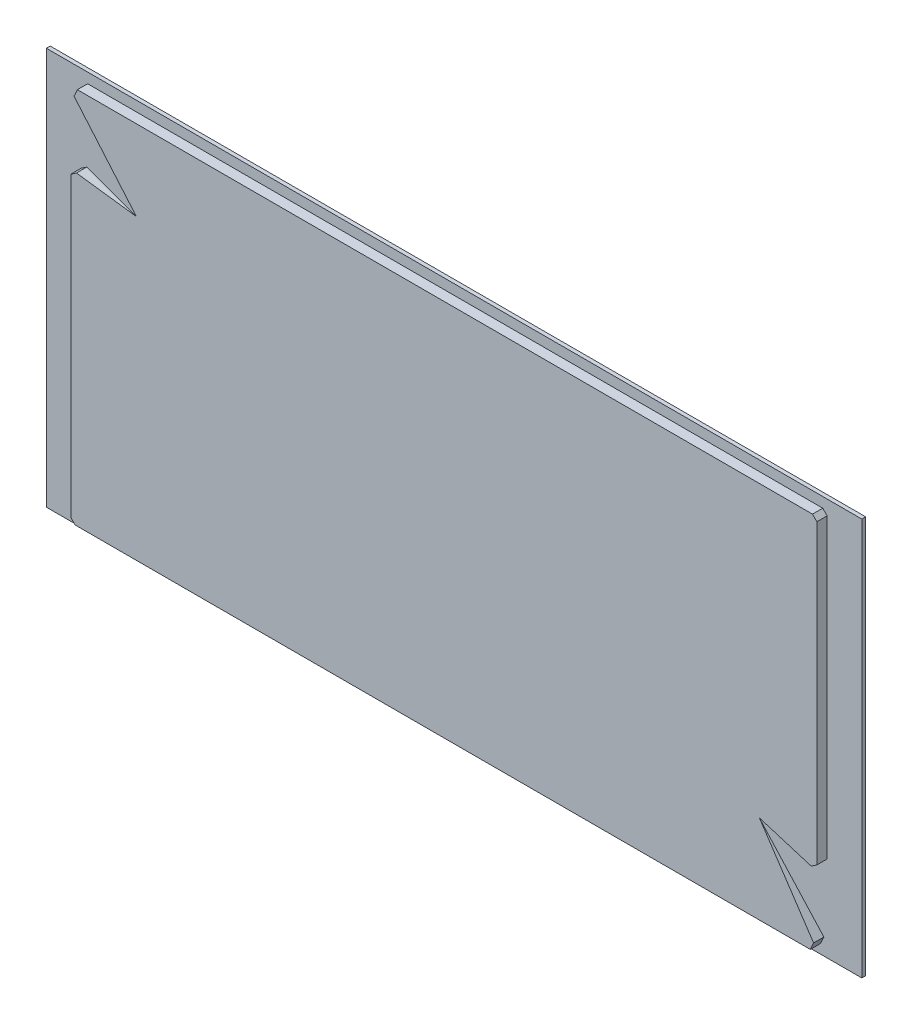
ISO-10303-21;
HEADER;
FILE_DESCRIPTION(('STEP AP214'),'2;1');
FILE_NAME('part.step','',(''),(''),'','','');
FILE_SCHEMA(('AUTOMOTIVE_DESIGN { 1 0 10303 214 1 1 1 1 }'));
ENDSEC;
DATA;
#1=APPLICATION_CONTEXT('core data for automotive mechanical design processes');
#2=APPLICATION_PROTOCOL_DEFINITION('international standard','automotive_design',2000,#1);
#3=PRODUCT_CONTEXT('',#1,'mechanical');
#4=PRODUCT('Part','Part','',(#3));
#5=PRODUCT_RELATED_PRODUCT_CATEGORY('part','',(#4));
#6=PRODUCT_DEFINITION_FORMATION('','',#4);
#7=PRODUCT_DEFINITION_CONTEXT('part definition',#1,'design');
#8=PRODUCT_DEFINITION('design','',#6,#7);
#9=PRODUCT_DEFINITION_SHAPE('','',#8);
#10=(LENGTH_UNIT() NAMED_UNIT(*) SI_UNIT(.MILLI.,.METRE.));
#11=(NAMED_UNIT(*) PLANE_ANGLE_UNIT() SI_UNIT($,.RADIAN.));
#12=(NAMED_UNIT(*) SI_UNIT($,.STERADIAN.) SOLID_ANGLE_UNIT());
#13=UNCERTAINTY_MEASURE_WITH_UNIT(LENGTH_MEASURE(1.E-05),#10,'distance_accuracy_value','');
#14=(GEOMETRIC_REPRESENTATION_CONTEXT(3) GLOBAL_UNCERTAINTY_ASSIGNED_CONTEXT((#13)) GLOBAL_UNIT_ASSIGNED_CONTEXT((#10,
#11,#12)) REPRESENTATION_CONTEXT('',''));
#15=CARTESIAN_POINT('',(0.,0.,0.));
#16=DIRECTION('',(0.,0.,1.));
#17=DIRECTION('',(1.,0.,0.));
#18=AXIS2_PLACEMENT_3D('',#15,#16,#17);
#19=CARTESIAN_POINT('',(-20.473861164,-11.721561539,-10.367481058));
#20=DIRECTION('',(0.,0.,1.));
#21=DIRECTION('',(1.,0.,0.));
#22=AXIS2_PLACEMENT_3D('',#19,#20,#21);
#23=PLANE('',#22);
#24=DIRECTION('',(1.,0.,0.));
#25=VECTOR('',#24,1.);
#26=CARTESIAN_POINT('',(-4.573861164,3.778438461,-10.367481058));
#27=LINE('',#26,#25);
#28=CARTESIAN_POINT('',(-20.473861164,3.778438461,-10.367481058));
#29=VERTEX_POINT('',#28);
#30=CARTESIAN_POINT('',(11.326138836,3.778438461,-10.367481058));
#31=VERTEX_POINT('',#30);
#32=EDGE_CURVE('P0_E80',#29,#31,#27,.T.);
#33=ORIENTED_EDGE('',*,*,#32,.T.);
#34=DIRECTION('',(0.,-1.,0.));
#35=VECTOR('',#34,1.);
#36=CARTESIAN_POINT('',(11.326138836,-3.971561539,-10.367481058));
#37=LINE('',#36,#35);
#38=CARTESIAN_POINT('',(11.326138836,-11.721561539,-10.367481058));
#39=VERTEX_POINT('',#38);
#40=EDGE_CURVE('P0_E67',#31,#39,#37,.T.);
#41=ORIENTED_EDGE('',*,*,#40,.T.);
#42=DIRECTION('',(-1.,0.,0.));
#43=VECTOR('',#42,1.);
#44=CARTESIAN_POINT('',(-4.573861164,-11.721561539,-10.367481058));
#45=LINE('',#44,#43);
#46=CARTESIAN_POINT('',(-20.473861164,-11.721561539,-10.367481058));
#47=VERTEX_POINT('',#46);
#48=EDGE_CURVE('P0_E54',#39,#47,#45,.T.);
#49=ORIENTED_EDGE('',*,*,#48,.T.);
#50=DIRECTION('',(0.,1.,0.));
#51=VECTOR('',#50,1.);
#52=CARTESIAN_POINT('',(-20.473861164,-3.971561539,-10.367481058));
#53=LINE('',#52,#51);
#54=EDGE_CURVE('P0_E19',#47,#29,#53,.T.);
#55=ORIENTED_EDGE('',*,*,#54,.T.);
#56=EDGE_LOOP('',(#33,#41,#49,#55));
#57=FACE_BOUND('',#56,.T.);
#58=ADVANCED_FACE('P0_F15',(#57),#23,.F.);
#59=CARTESIAN_POINT('',(-20.473861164,-11.721561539,-10.367481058));
#60=DIRECTION('',(1.,0.,0.));
#61=DIRECTION('',(0.,1.,0.));
#62=AXIS2_PLACEMENT_3D('',#59,#60,#61);
#63=PLANE('',#62);
#64=DIRECTION('',(0.,0.,1.));
#65=VECTOR('',#64,1.);
#66=CARTESIAN_POINT('',(-20.473861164,-11.721561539,-10.292481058));
#67=LINE('',#66,#65);
#68=CARTESIAN_POINT('',(-20.473861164,-11.721561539,-10.217481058));
#69=VERTEX_POINT('',#68);
#70=EDGE_CURVE('P0_E60',#47,#69,#67,.T.);
#71=ORIENTED_EDGE('',*,*,#70,.T.);
#72=DIRECTION('',(0.,-1.,0.));
#73=VECTOR('',#72,1.);
#74=CARTESIAN_POINT('',(-20.473861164,-3.971561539,-10.217481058));
#75=LINE('',#74,#73);
#76=CARTESIAN_POINT('',(-20.473861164,3.778438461,-10.217481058));
#77=VERTEX_POINT('',#76);
#78=EDGE_CURVE('P0_E82',#77,#69,#75,.T.);
#79=ORIENTED_EDGE('',*,*,#78,.F.);
#80=DIRECTION('',(0.,0.,-1.));
#81=VECTOR('',#80,1.);
#82=CARTESIAN_POINT('',(-20.473861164,3.778438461,-10.292481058));
#83=LINE('',#82,#81);
#84=EDGE_CURVE('P0_E63',#77,#29,#83,.T.);
#85=ORIENTED_EDGE('',*,*,#84,.T.);
#86=ORIENTED_EDGE('',*,*,#54,.F.);
#87=EDGE_LOOP('',(#71,#79,#85,#86));
#88=FACE_BOUND('',#87,.T.);
#89=ADVANCED_FACE('P0_F59',(#88),#63,.F.);
#90=CARTESIAN_POINT('',(-20.473861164,-11.721561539,-10.367481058));
#91=DIRECTION('',(0.,1.,0.));
#92=DIRECTION('',(0.,0.,1.));
#93=AXIS2_PLACEMENT_3D('',#90,#91,#92);
#94=PLANE('',#93);
#95=DIRECTION('',(0.,0.,1.));
#96=VECTOR('',#95,1.);
#97=CARTESIAN_POINT('',(11.326138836,-11.721561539,-10.292481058));
#98=LINE('',#97,#96);
#99=CARTESIAN_POINT('',(11.326138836,-11.721561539,-10.217481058));
#100=VERTEX_POINT('',#99);
#101=EDGE_CURVE('P0_E69',#39,#100,#98,.T.);
#102=ORIENTED_EDGE('',*,*,#101,.T.);
#103=DIRECTION('',(1.,0.,0.));
#104=VECTOR('',#103,1.);
#105=CARTESIAN_POINT('',(-4.573861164,-11.721561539,-10.217481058));
#106=LINE('',#105,#104);
#107=EDGE_CURVE('P0_E73',#69,#100,#106,.T.);
#108=ORIENTED_EDGE('',*,*,#107,.F.);
#109=ORIENTED_EDGE('',*,*,#70,.F.);
#110=ORIENTED_EDGE('',*,*,#48,.F.);
#111=EDGE_LOOP('',(#102,#108,#109,#110));
#112=FACE_BOUND('',#111,.T.);
#113=ADVANCED_FACE('P0_F71',(#112),#94,.F.);
#114=CARTESIAN_POINT('',(11.326138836,3.778438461,-10.367481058));
#115=DIRECTION('',(-1.,0.,0.));
#116=DIRECTION('',(0.,-1.,0.));
#117=AXIS2_PLACEMENT_3D('',#114,#115,#116);
#118=PLANE('',#117);
#119=DIRECTION('',(0.,0.,1.));
#120=VECTOR('',#119,1.);
#121=CARTESIAN_POINT('',(11.326138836,3.778438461,-10.292481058));
#122=LINE('',#121,#120);
#123=CARTESIAN_POINT('',(11.326138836,3.778438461,-10.217481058));
#124=VERTEX_POINT('',#123);
#125=EDGE_CURVE('P0_E34',#31,#124,#122,.T.);
#126=ORIENTED_EDGE('',*,*,#125,.T.);
#127=DIRECTION('',(0.,1.,0.));
#128=VECTOR('',#127,1.);
#129=CARTESIAN_POINT('',(11.326138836,-3.971561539,-10.217481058));
#130=LINE('',#129,#128);
#131=EDGE_CURVE('P0_E25',#100,#124,#130,.T.);
#132=ORIENTED_EDGE('',*,*,#131,.F.);
#133=ORIENTED_EDGE('',*,*,#101,.F.);
#134=ORIENTED_EDGE('',*,*,#40,.F.);
#135=EDGE_LOOP('',(#126,#132,#133,#134));
#136=FACE_BOUND('',#135,.T.);
#137=ADVANCED_FACE('P0_F87',(#136),#118,.F.);
#138=CARTESIAN_POINT('',(-20.473861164,3.778438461,-10.217481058));
#139=DIRECTION('',(0.,-1.,0.));
#140=DIRECTION('',(0.,0.,-1.));
#141=AXIS2_PLACEMENT_3D('',#138,#139,#140);
#142=PLANE('',#141);
#143=ORIENTED_EDGE('',*,*,#84,.F.);
#144=DIRECTION('',(-1.,0.,0.));
#145=VECTOR('',#144,1.);
#146=CARTESIAN_POINT('',(-4.573861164,3.778438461,-10.217481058));
#147=LINE('',#146,#145);
#148=EDGE_CURVE('P0_E10',#124,#77,#147,.T.);
#149=ORIENTED_EDGE('',*,*,#148,.F.);
#150=ORIENTED_EDGE('',*,*,#125,.F.);
#151=ORIENTED_EDGE('',*,*,#32,.F.);
#152=EDGE_LOOP('',(#143,#149,#150,#151));
#153=FACE_BOUND('',#152,.T.);
#154=ADVANCED_FACE('P0_F89',(#153),#142,.F.);
#155=CARTESIAN_POINT('',(-20.473861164,-11.721561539,-10.217481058));
#156=DIRECTION('',(0.,0.,1.));
#157=DIRECTION('',(1.,0.,0.));
#158=AXIS2_PLACEMENT_3D('',#155,#156,#157);
#159=PLANE('',#158);
#160=ORIENTED_EDGE('',*,*,#131,.T.);
#161=ORIENTED_EDGE('',*,*,#148,.T.);
#162=ORIENTED_EDGE('',*,*,#78,.T.);
#163=ORIENTED_EDGE('',*,*,#107,.T.);
#164=EDGE_LOOP('',(#160,#161,#162,#163));
#165=FACE_BOUND('',#164,.T.);
#166=ADVANCED_FACE('P0_F17',(#165),#159,.T.);
#167=CLOSED_SHELL('',(#58,#89,#113,#137,#154,#166));
#168=MANIFOLD_SOLID_BREP('P0_B1',#167);
#169=CARTESIAN_POINT('',(9.846403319,-11.361617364,-9.817481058));
#170=DIRECTION('',(0.,0.,-1.));
#171=DIRECTION('',(-1.,0.,0.));
#172=AXIS2_PLACEMENT_3D('',#169,#170,#171);
#173=PLANE('',#172);
#174=DIRECTION('',(-0.707106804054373,0.707106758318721,0.));
#175=VECTOR('',#174,1.);
#176=CARTESIAN_POINT('',(-18.9503386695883,-11.361617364,-9.817481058));
#177=LINE('',#176,#175);
#178=CARTESIAN_POINT('',(-18.9503386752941,-11.361617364,-9.817481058));
#179=VERTEX_POINT('',#178);
#180=CARTESIAN_POINT('',(-19.121788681,-11.1901673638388,-9.817481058));
#181=VERTEX_POINT('',#180);
#182=EDGE_CURVE('P1_E24',#179,#181,#177,.T.);
#183=ORIENTED_EDGE('',*,*,#182,.T.);
#184=DIRECTION('',(0.,1.,0.));
#185=VECTOR('',#184,1.);
#186=CARTESIAN_POINT('',(-19.121788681,-5.405444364,-9.817481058));
#187=LINE('',#186,#185);
#188=CARTESIAN_POINT('',(-19.121788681,0.399852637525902,-9.817481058));
#189=VERTEX_POINT('',#188);
#190=EDGE_CURVE('P1_E11',#181,#189,#187,.T.);
#191=ORIENTED_EDGE('',*,*,#190,.T.);
#192=DIRECTION('',(0.826767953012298,0.56254311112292,0.));
#193=VECTOR('',#192,1.);
#194=CARTESIAN_POINT('',(-19.121788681,0.399852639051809,-9.817481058));
#195=LINE('',#194,#193);
#196=CARTESIAN_POINT('',(-18.9000466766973,0.550728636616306,-9.817481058));
#197=VERTEX_POINT('',#196);
#198=EDGE_CURVE('P1_E198',#189,#197,#195,.T.);
#199=ORIENTED_EDGE('',*,*,#198,.T.);
#200=DIRECTION('',(0.94832915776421,-0.317288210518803,0.));
#201=VECTOR('',#200,1.);
#202=CARTESIAN_POINT('',(-18.900046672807,0.550728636,-9.817481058));
#203=LINE('',#202,#201);
#204=CARTESIAN_POINT('',(-16.7213717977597,0.0910334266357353,-9.97611658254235));
#205=VERTEX_POINT('',#204);
#206=EDGE_CURVE('P1_E193',#197,#205,#203,.T.);
#207=ORIENTED_EDGE('',*,*,#206,.T.);
#208=DIRECTION('',(-0.644253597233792,0.764811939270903,0.));
#209=VECTOR('',#208,1.);
#210=CARTESIAN_POINT('',(-16.6852656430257,0.358453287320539,-9.817481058));
#211=LINE('',#210,#209);
#212=CARTESIAN_POINT('',(-18.9941256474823,3.09936728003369,-9.817481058));
#213=VERTEX_POINT('',#212);
#214=EDGE_CURVE('P1_E33',#205,#213,#211,.T.);
#215=ORIENTED_EDGE('',*,*,#214,.T.);
#216=DIRECTION('',(0.417663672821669,0.908601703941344,0.));
#217=VECTOR('',#216,1.);
#218=CARTESIAN_POINT('',(-18.994125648,3.09936727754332,-9.817481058));
#219=LINE('',#218,#217);
#220=CARTESIAN_POINT('',(-18.8638236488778,3.382831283,-9.817481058));
#221=VERTEX_POINT('',#220);
#222=EDGE_CURVE('P1_E172',#213,#221,#219,.T.);
#223=ORIENTED_EDGE('',*,*,#222,.T.);
#224=DIRECTION('',(1.,0.,0.));
#225=VECTOR('',#224,1.);
#226=CARTESIAN_POINT('',(-4.510029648,3.382831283,-9.817481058));
#227=LINE('',#226,#225);
#228=CARTESIAN_POINT('',(9.80261634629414,3.382831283,-9.817481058));
#229=VERTEX_POINT('',#228);
#230=EDGE_CURVE('P1_E168',#221,#229,#227,.T.);
#231=ORIENTED_EDGE('',*,*,#230,.T.);
#232=DIRECTION('',(0.70710680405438,-0.707106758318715,0.));
#233=VECTOR('',#232,1.);
#234=CARTESIAN_POINT('',(9.80261634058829,3.382831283,-9.817481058));
#235=LINE('',#234,#233);
#236=CARTESIAN_POINT('',(9.974066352,3.21138128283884,-9.817481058));
#237=VERTEX_POINT('',#236);
#238=EDGE_CURVE('P1_E171',#229,#237,#235,.T.);
#239=ORIENTED_EDGE('',*,*,#238,.T.);
#240=DIRECTION('',(0.,-1.,0.));
#241=VECTOR('',#240,1.);
#242=CARTESIAN_POINT('',(9.974066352,-2.573341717,-9.817481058));
#243=LINE('',#242,#241);
#244=CARTESIAN_POINT('',(9.974066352,-8.3786387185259,-9.817481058));
#245=VERTEX_POINT('',#244);
#246=EDGE_CURVE('P1_E176',#237,#245,#243,.T.);
#247=ORIENTED_EDGE('',*,*,#246,.T.);
#248=DIRECTION('',(-0.826767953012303,-0.562543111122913,0.));
#249=VECTOR('',#248,1.);
#250=CARTESIAN_POINT('',(9.974066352,-8.37863872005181,-9.817481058));
#251=LINE('',#250,#249);
#252=CARTESIAN_POINT('',(9.75232434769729,-8.52951471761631,-9.817481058));
#253=VERTEX_POINT('',#252);
#254=EDGE_CURVE('P1_E19',#245,#253,#251,.T.);
#255=ORIENTED_EDGE('',*,*,#254,.T.);
#256=DIRECTION('',(-0.94832915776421,0.317288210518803,0.));
#257=VECTOR('',#256,1.);
#258=CARTESIAN_POINT('',(9.75232434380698,-8.529514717,-9.817481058));
#259=LINE('',#258,#257);
#260=CARTESIAN_POINT('',(7.57364946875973,-8.06981950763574,-9.97611658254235));
#261=VERTEX_POINT('',#260);
#262=EDGE_CURVE('P1_E112',#253,#261,#259,.T.);
#263=ORIENTED_EDGE('',*,*,#262,.T.);
#264=DIRECTION('',(0.644253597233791,-0.764811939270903,0.));
#265=VECTOR('',#264,1.);
#266=CARTESIAN_POINT('',(7.53754331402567,-8.33723936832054,-9.817481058));
#267=LINE('',#266,#265);
#268=CARTESIAN_POINT('',(9.84640331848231,-11.0781533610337,-9.817481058));
#269=VERTEX_POINT('',#268);
#270=EDGE_CURVE('P1_E190',#261,#269,#267,.T.);
#271=ORIENTED_EDGE('',*,*,#270,.T.);
#272=DIRECTION('',(-0.417663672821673,-0.908601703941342,0.));
#273=VECTOR('',#272,1.);
#274=CARTESIAN_POINT('',(9.846403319,-11.0781533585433,-9.817481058));
#275=LINE('',#274,#273);
#276=CARTESIAN_POINT('',(9.71610131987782,-11.361617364,-9.817481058));
#277=VERTEX_POINT('',#276);
#278=EDGE_CURVE('P1_E147',#269,#277,#275,.T.);
#279=ORIENTED_EDGE('',*,*,#278,.T.);
#280=DIRECTION('',(-1.,0.,0.));
#281=VECTOR('',#280,1.);
#282=CARTESIAN_POINT('',(-4.637692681,-11.361617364,-9.817481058));
#283=LINE('',#282,#281);
#284=EDGE_CURVE('P1_E144',#277,#179,#283,.T.);
#285=ORIENTED_EDGE('',*,*,#284,.T.);
#286=EDGE_LOOP('',(#183,#191,#199,#207,#215,#223,#231,#239,#247,#255,#263,#271,#279,#285));
#287=FACE_BOUND('',#286,.T.);
#288=ADVANCED_FACE('P1_F16',(#287),#173,.T.);
#289=CARTESIAN_POINT('',(-19.121788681,-11.190167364,-9.817481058));
#290=DIRECTION('',(1.,0.,0.));
#291=DIRECTION('',(0.,0.,-1.));
#292=AXIS2_PLACEMENT_3D('',#289,#290,#291);
#293=PLANE('',#292);
#294=DIRECTION('',(0.,0.,-1.));
#295=VECTOR('',#294,1.);
#296=CARTESIAN_POINT('',(-19.121788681,-11.190167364,-10.017481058));
#297=LINE('',#296,#295);
#298=CARTESIAN_POINT('',(-19.121788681,-11.190167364,-10.217481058));
#299=VERTEX_POINT('',#298);
#300=EDGE_CURVE('P1_E148',#181,#299,#297,.T.);
#301=ORIENTED_EDGE('',*,*,#300,.T.);
#302=DIRECTION('',(0.,1.,0.));
#303=VECTOR('',#302,1.);
#304=CARTESIAN_POINT('',(-19.121788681,-5.395157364,-10.217481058));
#305=LINE('',#304,#303);
#306=CARTESIAN_POINT('',(-19.121788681,0.399852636,-10.217481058));
#307=VERTEX_POINT('',#306);
#308=EDGE_CURVE('P1_E150',#299,#307,#305,.T.);
#309=ORIENTED_EDGE('',*,*,#308,.T.);
#310=DIRECTION('',(0.,0.,1.));
#311=VECTOR('',#310,1.);
#312=CARTESIAN_POINT('',(-19.121788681,0.399852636,-10.017481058));
#313=LINE('',#312,#311);
#314=EDGE_CURVE('P1_E151',#307,#189,#313,.T.);
#315=ORIENTED_EDGE('',*,*,#314,.T.);
#316=ORIENTED_EDGE('',*,*,#190,.F.);
#317=EDGE_LOOP('',(#301,#309,#315,#316));
#318=FACE_BOUND('',#317,.T.);
#319=ADVANCED_FACE('P1_F244',(#318),#293,.T.);
#320=CARTESIAN_POINT('',(-18.950338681,-11.361617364,-10.217481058));
#321=DIRECTION('',(0.707106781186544,0.707106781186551,0.));
#322=DIRECTION('',(-0.707106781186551,0.707106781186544,0.));
#323=AXIS2_PLACEMENT_3D('',#320,#321,#322);
#324=PLANE('',#323);
#325=DIRECTION('',(0.,0.,-1.));
#326=VECTOR('',#325,1.);
#327=CARTESIAN_POINT('',(-18.950338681,-11.361617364,-10.017481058));
#328=LINE('',#327,#326);
#329=CARTESIAN_POINT('',(-18.950338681,-11.361617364,-10.217481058));
#330=VERTEX_POINT('',#329);
#331=EDGE_CURVE('P1_E139',#179,#330,#328,.T.);
#332=ORIENTED_EDGE('',*,*,#331,.T.);
#333=DIRECTION('',(-0.707106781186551,0.707106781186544,0.));
#334=VECTOR('',#333,1.);
#335=CARTESIAN_POINT('',(-19.036063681,-11.275892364,-10.217481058));
#336=LINE('',#335,#334);
#337=EDGE_CURVE('P1_E142',#330,#299,#336,.T.);
#338=ORIENTED_EDGE('',*,*,#337,.T.);
#339=ORIENTED_EDGE('',*,*,#300,.F.);
#340=ORIENTED_EDGE('',*,*,#182,.F.);
#341=EDGE_LOOP('',(#332,#338,#339,#340));
#342=FACE_BOUND('',#341,.T.);
#343=ADVANCED_FACE('P1_F286',(#342),#324,.T.);
#344=CARTESIAN_POINT('',(-18.950338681,-11.361617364,-10.217481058));
#345=DIRECTION('',(0.,1.,0.));
#346=DIRECTION('',(0.,0.,1.));
#347=AXIS2_PLACEMENT_3D('',#344,#345,#346);
#348=PLANE('',#347);
#349=DIRECTION('',(0.,0.,-1.));
#350=VECTOR('',#349,1.);
#351=CARTESIAN_POINT('',(9.716101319,-11.361617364,-10.017481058));
#352=LINE('',#351,#350);
#353=CARTESIAN_POINT('',(9.716101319,-11.361617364,-10.217481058));
#354=VERTEX_POINT('',#353);
#355=EDGE_CURVE('P1_E162',#277,#354,#352,.T.);
#356=ORIENTED_EDGE('',*,*,#355,.T.);
#357=DIRECTION('',(-1.,0.,0.));
#358=VECTOR('',#357,1.);
#359=CARTESIAN_POINT('',(-4.617118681,-11.361617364,-10.217481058));
#360=LINE('',#359,#358);
#361=EDGE_CURVE('P1_E143',#354,#330,#360,.T.);
#362=ORIENTED_EDGE('',*,*,#361,.T.);
#363=ORIENTED_EDGE('',*,*,#331,.F.);
#364=ORIENTED_EDGE('',*,*,#284,.F.);
#365=EDGE_LOOP('',(#356,#362,#363,#364));
#366=FACE_BOUND('',#365,.T.);
#367=ADVANCED_FACE('P1_F272',(#366),#348,.T.);
#368=CARTESIAN_POINT('',(9.846403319,-11.078153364,-10.217481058));
#369=DIRECTION('',(-0.908601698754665,0.417663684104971,0.));
#370=DIRECTION('',(-0.417663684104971,-0.908601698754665,0.));
#371=AXIS2_PLACEMENT_3D('',#368,#369,#370);
#372=PLANE('',#371);
#373=DIRECTION('',(0.,0.,-1.));
#374=VECTOR('',#373,1.);
#375=CARTESIAN_POINT('',(9.846403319,-11.078153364,-10.017481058));
#376=LINE('',#375,#374);
#377=CARTESIAN_POINT('',(9.846403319,-11.078153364,-10.217481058));
#378=VERTEX_POINT('',#377);
#379=EDGE_CURVE('P1_E133',#269,#378,#376,.T.);
#380=ORIENTED_EDGE('',*,*,#379,.T.);
#381=DIRECTION('',(-0.417663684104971,-0.908601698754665,0.));
#382=VECTOR('',#381,1.);
#383=CARTESIAN_POINT('',(9.781252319,-11.219885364,-10.217481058));
#384=LINE('',#383,#382);
#385=EDGE_CURVE('P1_E161',#378,#354,#384,.T.);
#386=ORIENTED_EDGE('',*,*,#385,.T.);
#387=ORIENTED_EDGE('',*,*,#355,.F.);
#388=ORIENTED_EDGE('',*,*,#278,.F.);
#389=EDGE_LOOP('',(#380,#386,#387,#388));
#390=FACE_BOUND('',#389,.T.);
#391=ADVANCED_FACE('P1_F265',(#390),#372,.T.);
#392=CARTESIAN_POINT('',(7.537543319,-8.337239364,-10.217481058));
#393=DIRECTION('',(-0.764811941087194,-0.64425359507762,0.));
#394=DIRECTION('',(0.64425359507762,-0.764811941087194,0.));
#395=AXIS2_PLACEMENT_3D('',#392,#393,#394);
#396=PLANE('',#395);
#397=ORIENTED_EDGE('',*,*,#270,.F.);
#398=DIRECTION('',(0.64425359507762,-0.764811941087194,0.));
#399=VECTOR('',#398,1.);
#400=CARTESIAN_POINT('',(8.691973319,-9.707696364,-10.217481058));
#401=LINE('',#400,#399);
#402=EDGE_CURVE('P1_E130',#261,#378,#401,.T.);
#403=ORIENTED_EDGE('',*,*,#402,.T.);
#404=ORIENTED_EDGE('',*,*,#379,.F.);
#405=EDGE_LOOP('',(#397,#403,#404));
#406=FACE_BOUND('',#405,.T.);
#407=ADVANCED_FACE('P1_F277',(#406),#396,.T.);
#408=CARTESIAN_POINT('',(-18.900046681,0.550728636,-10.217481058));
#409=DIRECTION('',(-0.317288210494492,-0.948329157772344,0.));
#410=DIRECTION('',(0.948329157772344,-0.317288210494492,0.));
#411=AXIS2_PLACEMENT_3D('',#408,#409,#410);
#412=PLANE('',#411);
#413=DIRECTION('',(0.,0.,-1.));
#414=VECTOR('',#413,1.);
#415=CARTESIAN_POINT('',(-18.900046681,0.550728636,-10.017481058));
#416=LINE('',#415,#414);
#417=CARTESIAN_POINT('',(-18.900046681,0.550728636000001,-10.217481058));
#418=VERTEX_POINT('',#417);
#419=EDGE_CURVE('P1_E155',#197,#418,#416,.T.);
#420=ORIENTED_EDGE('',*,*,#419,.T.);
#421=DIRECTION('',(0.948329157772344,-0.317288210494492,0.));
#422=VECTOR('',#421,1.);
#423=CARTESIAN_POINT('',(-5.716684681,-3.860108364,-10.217481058));
#424=LINE('',#423,#422);
#425=EDGE_CURVE('P1_E134',#418,#205,#424,.T.);
#426=ORIENTED_EDGE('',*,*,#425,.T.);
#427=ORIENTED_EDGE('',*,*,#206,.F.);
#428=EDGE_LOOP('',(#420,#426,#427));
#429=FACE_BOUND('',#428,.T.);
#430=ADVANCED_FACE('P1_F233',(#429),#412,.T.);
#431=CARTESIAN_POINT('',(-19.121788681,0.399852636,-10.217481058));
#432=DIRECTION('',(0.562543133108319,-0.826767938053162,0.));
#433=DIRECTION('',(0.826767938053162,0.562543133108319,0.));
#434=AXIS2_PLACEMENT_3D('',#431,#432,#433);
#435=PLANE('',#434);
#436=ORIENTED_EDGE('',*,*,#314,.F.);
#437=DIRECTION('',(0.826767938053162,0.562543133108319,0.));
#438=VECTOR('',#437,1.);
#439=CARTESIAN_POINT('',(-19.010917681,0.475290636,-10.217481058));
#440=LINE('',#439,#438);
#441=EDGE_CURVE('P1_E158',#307,#418,#440,.T.);
#442=ORIENTED_EDGE('',*,*,#441,.T.);
#443=ORIENTED_EDGE('',*,*,#419,.F.);
#444=ORIENTED_EDGE('',*,*,#198,.F.);
#445=EDGE_LOOP('',(#436,#442,#443,#444));
#446=FACE_BOUND('',#445,.T.);
#447=ADVANCED_FACE('P1_F238',(#446),#435,.T.);
#448=CARTESIAN_POINT('',(9.974066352,3.211381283,-9.817481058));
#449=DIRECTION('',(-1.,0.,0.));
#450=DIRECTION('',(0.,0.,-1.));
#451=AXIS2_PLACEMENT_3D('',#448,#449,#450);
#452=PLANE('',#451);
#453=DIRECTION('',(0.,0.,-1.));
#454=VECTOR('',#453,1.);
#455=CARTESIAN_POINT('',(9.974066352,3.211381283,-10.017481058));
#456=LINE('',#455,#454);
#457=CARTESIAN_POINT('',(9.974066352,3.211381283,-10.217481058));
#458=VERTEX_POINT('',#457);
#459=EDGE_CURVE('P1_E173',#237,#458,#456,.T.);
#460=ORIENTED_EDGE('',*,*,#459,.T.);
#461=DIRECTION('',(0.,-1.,0.));
#462=VECTOR('',#461,1.);
#463=CARTESIAN_POINT('',(9.974066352,-2.583628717,-10.217481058));
#464=LINE('',#463,#462);
#465=CARTESIAN_POINT('',(9.974066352,-8.378638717,-10.217481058));
#466=VERTEX_POINT('',#465);
#467=EDGE_CURVE('P1_E175',#458,#466,#464,.T.);
#468=ORIENTED_EDGE('',*,*,#467,.T.);
#469=DIRECTION('',(0.,0.,1.));
#470=VECTOR('',#469,1.);
#471=CARTESIAN_POINT('',(9.974066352,-8.378638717,-10.017481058));
#472=LINE('',#471,#470);
#473=EDGE_CURVE('P1_E102',#466,#245,#472,.T.);
#474=ORIENTED_EDGE('',*,*,#473,.T.);
#475=ORIENTED_EDGE('',*,*,#246,.F.);
#476=EDGE_LOOP('',(#460,#468,#474,#475));
#477=FACE_BOUND('',#476,.T.);
#478=ADVANCED_FACE('P1_F306',(#477),#452,.T.);
#479=CARTESIAN_POINT('',(9.802616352,3.382831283,-10.217481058));
#480=DIRECTION('',(-0.70710678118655,-0.707106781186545,0.));
#481=DIRECTION('',(0.707106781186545,-0.70710678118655,0.));
#482=AXIS2_PLACEMENT_3D('',#479,#480,#481);
#483=PLANE('',#482);
#484=DIRECTION('',(0.,0.,-1.));
#485=VECTOR('',#484,1.);
#486=CARTESIAN_POINT('',(9.802616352,3.382831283,-10.017481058));
#487=LINE('',#486,#485);
#488=CARTESIAN_POINT('',(9.802616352,3.382831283,-10.217481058));
#489=VERTEX_POINT('',#488);
#490=EDGE_CURVE('P1_E165',#229,#489,#487,.T.);
#491=ORIENTED_EDGE('',*,*,#490,.T.);
#492=DIRECTION('',(0.707106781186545,-0.70710678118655,0.));
#493=VECTOR('',#492,1.);
#494=CARTESIAN_POINT('',(9.888341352,3.297106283,-10.217481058));
#495=LINE('',#494,#493);
#496=EDGE_CURVE('P1_E83',#489,#458,#495,.T.);
#497=ORIENTED_EDGE('',*,*,#496,.T.);
#498=ORIENTED_EDGE('',*,*,#459,.F.);
#499=ORIENTED_EDGE('',*,*,#238,.F.);
#500=EDGE_LOOP('',(#491,#497,#498,#499));
#501=FACE_BOUND('',#500,.T.);
#502=ADVANCED_FACE('P1_F309',(#501),#483,.T.);
#503=CARTESIAN_POINT('',(9.802616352,3.382831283,-10.217481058));
#504=DIRECTION('',(0.,-1.,0.));
#505=DIRECTION('',(0.,0.,1.));
#506=AXIS2_PLACEMENT_3D('',#503,#504,#505);
#507=PLANE('',#506);
#508=DIRECTION('',(0.,0.,-1.));
#509=VECTOR('',#508,1.);
#510=CARTESIAN_POINT('',(-18.863823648,3.382831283,-10.017481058));
#511=LINE('',#510,#509);
#512=CARTESIAN_POINT('',(-18.863823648,3.382831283,-10.217481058));
#513=VERTEX_POINT('',#512);
#514=EDGE_CURVE('P1_E183',#221,#513,#511,.T.);
#515=ORIENTED_EDGE('',*,*,#514,.T.);
#516=DIRECTION('',(1.,0.,0.));
#517=VECTOR('',#516,1.);
#518=CARTESIAN_POINT('',(-4.530603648,3.382831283,-10.217481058));
#519=LINE('',#518,#517);
#520=EDGE_CURVE('P1_E167',#513,#489,#519,.T.);
#521=ORIENTED_EDGE('',*,*,#520,.T.);
#522=ORIENTED_EDGE('',*,*,#490,.F.);
#523=ORIENTED_EDGE('',*,*,#230,.F.);
#524=EDGE_LOOP('',(#515,#521,#522,#523));
#525=FACE_BOUND('',#524,.T.);
#526=ADVANCED_FACE('P1_F312',(#525),#507,.T.);
#527=CARTESIAN_POINT('',(-18.994125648,3.099367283,-10.217481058));
#528=DIRECTION('',(0.908601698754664,-0.417663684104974,0.));
#529=DIRECTION('',(0.417663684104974,0.908601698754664,0.));
#530=AXIS2_PLACEMENT_3D('',#527,#528,#529);
#531=PLANE('',#530);
#532=DIRECTION('',(0.,0.,-1.));
#533=VECTOR('',#532,1.);
#534=CARTESIAN_POINT('',(-18.994125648,3.099367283,-10.017481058));
#535=LINE('',#534,#533);
#536=CARTESIAN_POINT('',(-18.994125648,3.099367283,-10.217481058));
#537=VERTEX_POINT('',#536);
#538=EDGE_CURVE('P1_E122',#213,#537,#535,.T.);
#539=ORIENTED_EDGE('',*,*,#538,.T.);
#540=DIRECTION('',(0.417663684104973,0.908601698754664,0.));
#541=VECTOR('',#540,1.);
#542=CARTESIAN_POINT('',(-18.928974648,3.241099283,-10.217481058));
#543=LINE('',#542,#541);
#544=EDGE_CURVE('P1_E182',#537,#513,#543,.T.);
#545=ORIENTED_EDGE('',*,*,#544,.T.);
#546=ORIENTED_EDGE('',*,*,#514,.F.);
#547=ORIENTED_EDGE('',*,*,#222,.F.);
#548=EDGE_LOOP('',(#539,#545,#546,#547));
#549=FACE_BOUND('',#548,.T.);
#550=ADVANCED_FACE('P1_F315',(#549),#531,.T.);
#551=CARTESIAN_POINT('',(-16.685265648,0.358453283,-10.217481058));
#552=DIRECTION('',(0.764811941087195,0.64425359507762,0.));
#553=DIRECTION('',(-0.64425359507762,0.764811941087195,0.));
#554=AXIS2_PLACEMENT_3D('',#551,#552,#553);
#555=PLANE('',#554);
#556=ORIENTED_EDGE('',*,*,#214,.F.);
#557=DIRECTION('',(-0.64425359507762,0.764811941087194,0.));
#558=VECTOR('',#557,1.);
#559=CARTESIAN_POINT('',(-17.839695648,1.728910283,-10.217481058));
#560=LINE('',#559,#558);
#561=EDGE_CURVE('P1_E115',#205,#537,#560,.T.);
#562=ORIENTED_EDGE('',*,*,#561,.T.);
#563=ORIENTED_EDGE('',*,*,#538,.F.);
#564=EDGE_LOOP('',(#556,#562,#563));
#565=FACE_BOUND('',#564,.T.);
#566=ADVANCED_FACE('P1_F319',(#565),#555,.T.);
#567=CARTESIAN_POINT('',(9.752324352,-8.529514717,-10.217481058));
#568=DIRECTION('',(0.317288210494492,0.948329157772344,0.));
#569=DIRECTION('',(-0.948329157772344,0.317288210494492,0.));
#570=AXIS2_PLACEMENT_3D('',#567,#568,#569);
#571=PLANE('',#570);
#572=DIRECTION('',(0.,0.,-1.));
#573=VECTOR('',#572,1.);
#574=CARTESIAN_POINT('',(9.752324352,-8.529514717,-10.017481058));
#575=LINE('',#574,#573);
#576=CARTESIAN_POINT('',(9.752324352,-8.529514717,-10.217481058));
#577=VERTEX_POINT('',#576);
#578=EDGE_CURVE('P1_E101',#253,#577,#575,.T.);
#579=ORIENTED_EDGE('',*,*,#578,.T.);
#580=DIRECTION('',(-0.948329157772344,0.317288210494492,0.));
#581=VECTOR('',#580,1.);
#582=CARTESIAN_POINT('',(-3.431037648,-4.118677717,-10.217481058));
#583=LINE('',#582,#581);
#584=EDGE_CURVE('P1_E110',#577,#261,#583,.T.);
#585=ORIENTED_EDGE('',*,*,#584,.T.);
#586=ORIENTED_EDGE('',*,*,#262,.F.);
#587=EDGE_LOOP('',(#579,#585,#586));
#588=FACE_BOUND('',#587,.T.);
#589=ADVANCED_FACE('P1_F109',(#588),#571,.T.);
#590=CARTESIAN_POINT('',(9.974066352,-8.378638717,-10.217481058));
#591=DIRECTION('',(-0.562543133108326,0.826767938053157,0.));
#592=DIRECTION('',(-0.826767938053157,-0.562543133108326,0.));
#593=AXIS2_PLACEMENT_3D('',#590,#591,#592);
#594=PLANE('',#593);
#595=ORIENTED_EDGE('',*,*,#473,.F.);
#596=DIRECTION('',(-0.826767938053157,-0.562543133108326,0.));
#597=VECTOR('',#596,1.);
#598=CARTESIAN_POINT('',(9.863195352,-8.454076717,-10.217481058));
#599=LINE('',#598,#597);
#600=EDGE_CURVE('P1_E99',#466,#577,#599,.T.);
#601=ORIENTED_EDGE('',*,*,#600,.T.);
#602=ORIENTED_EDGE('',*,*,#578,.F.);
#603=ORIENTED_EDGE('',*,*,#254,.F.);
#604=EDGE_LOOP('',(#595,#601,#602,#603));
#605=FACE_BOUND('',#604,.T.);
#606=ADVANCED_FACE('P1_F17',(#605),#594,.T.);
#607=OPEN_SHELL('',(#288,#319,#343,#367,#391,#407,#430,#447,#478,#502,#526,#550,#566,#589,#606));
#608=SHELL_BASED_SURFACE_MODEL('P1_B1',(#607));
#609=ADVANCED_BREP_SHAPE_REPRESENTATION('',(#18,#168),#14);
#610=MANIFOLD_SURFACE_SHAPE_REPRESENTATION('',(#18,#608),#14);
#611=SHAPE_REPRESENTATION('',(#18),#14);
#612=SHAPE_DEFINITION_REPRESENTATION(#9,#611);
#613=SHAPE_REPRESENTATION_RELATIONSHIP('','',#611,#609);
#614=SHAPE_REPRESENTATION_RELATIONSHIP('','',#611,#610);
ENDSEC;
END-ISO-10303-21;
